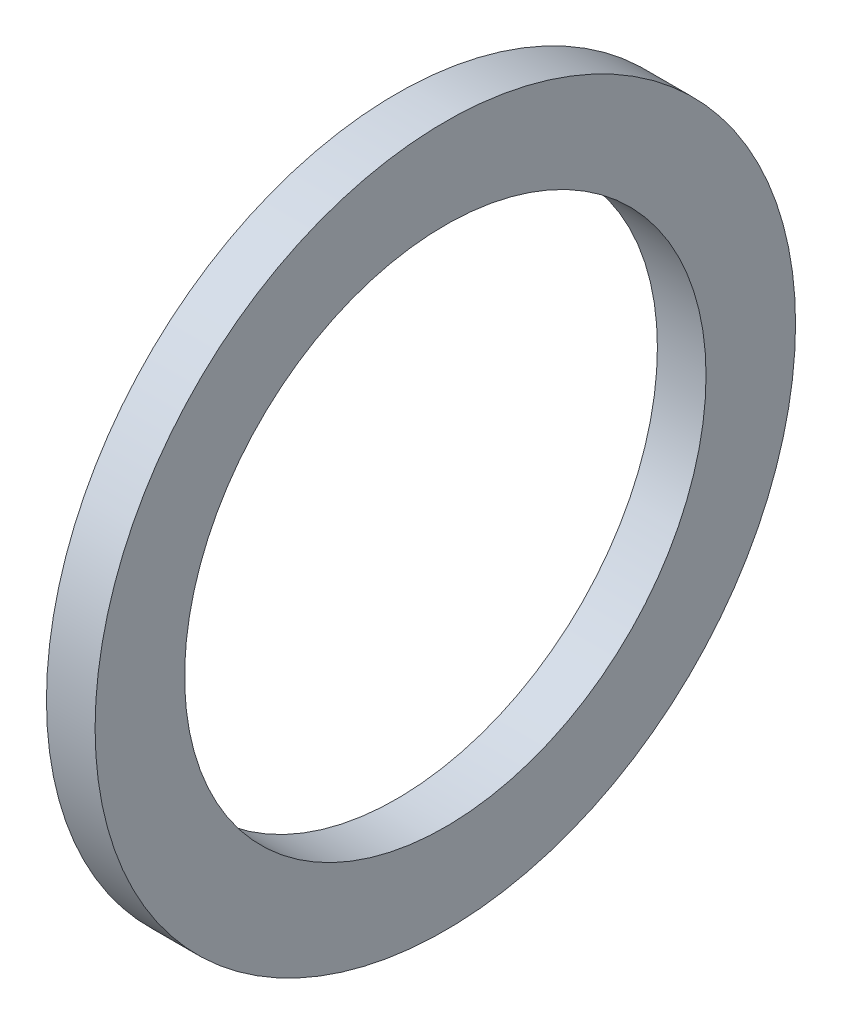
from build123d import *

# Parameters (mm, degrees)
ESQUISSE1_W = 2.5
ESQUISSE1_H = 4.6


with BuildPart() as part:
    # Esquisse1 → R_volution1 (revolve)
    with BuildSketch(Plane.XY, mode=Mode.PRIVATE) as r_volution1_sk:
        with Locations((-13.595776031, 15.7)):
            Rectangle(ESQUISSE1_W, ESQUISSE1_H)
    revolve(r_volution1_sk.sketch.rotate(Axis((0, 0, 0), (-1, 0, 0)), 90), axis=Axis((0, 0, 0), (-1, 0, 0)))


solid = part.part
